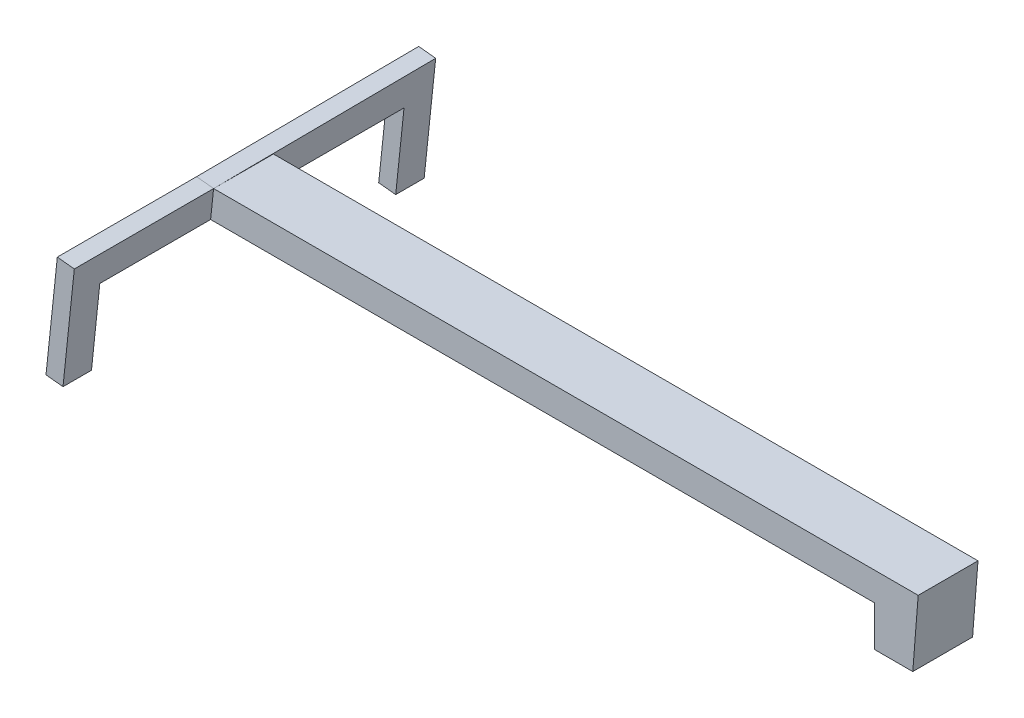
from build123d import *

# Parameters (mm, degrees)
SKETCH1_W           = 248
SKETCH1_H           = 24.14
BOSS_EXTRUDE1_DEPTH = 21
BOSS_EXTRUDE3_DEPTH = 21
CUT_EXTRUDE1_DEPTH  = 129.208655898
BOSS_EXTRUDE4_DEPTH = 6
SKETCH6_W           = 106.8
SKETCH6_H           = 28
CUT_EXTRUDE2_DEPTH  = 6
CUT_EXTRUDE3_DEPTH  = 155.908061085


with BuildPart() as part:
    # Sketch1 → Boss-Extrude1 (new body)
    with BuildSketch(Plane.XY):
        Rectangle(SKETCH1_W, SKETCH1_H)
    extrude(amount=BOSS_EXTRUDE1_DEPTH)

    # Sketch3 → Boss-Extrude3 (add)
    with BuildSketch(Plane.XY.offset(21)):
        Polygon((124, 12.07), (124, -12.07), (125.899859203, 12.07), align=None)
    extrude(amount=-BOSS_EXTRUDE3_DEPTH)

    # Sketch4 → Cut-Extrude1 (cut, through all)
    with BuildSketch(Plane.XY.offset(21)):
        Polygon((-124, 12.07), (-124, -12.07), (-121.462783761, 12.07), align=None)
    extrude(amount=-CUT_EXTRUDE1_DEPTH, mode=Mode.SUBTRACT)

    # Sketch5 → Boss-Extrude4 (add)
    with BuildSketch(Plane(origin=(-121.390404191, 12.758645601, 0), x_dir=(0, 0, 1), z_dir=(-0.9945218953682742, 0.10452846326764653, 0))):
        Polygon((21, -0.692438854), (69.9, -0.692438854), (69.9, -38.692438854), (-56.9, -38.692438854), (-56.9, 0), align=None)
    extrude(amount=BOSS_EXTRUDE4_DEPTH)

    # Sketch6 → Cut-Extrude2 (cut)
    with BuildSketch(Plane(origin=(-127.357535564, 13.385816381, 0), x_dir=(0, 0, 1), z_dir=(-0.9945218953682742, 0.1045284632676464, 0))):
        with Locations((6.5, -24.692438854)):
            Rectangle(SKETCH6_W, SKETCH6_H)
    extrude(amount=-CUT_EXTRUDE2_DEPTH, mode=Mode.SUBTRACT)

    # Sketch7 → Cut-Extrude3 (cut, through all)
    with BuildSketch(Plane.XY.offset(21)):
        Polygon((-122.508068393, 2.124781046), (110.478386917, 2.124781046), (110.478386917, -12.07), (-124, -12.07), align=None)
    extrude(amount=-CUT_EXTRUDE3_DEPTH, mode=Mode.SUBTRACT)


solid = part.part
